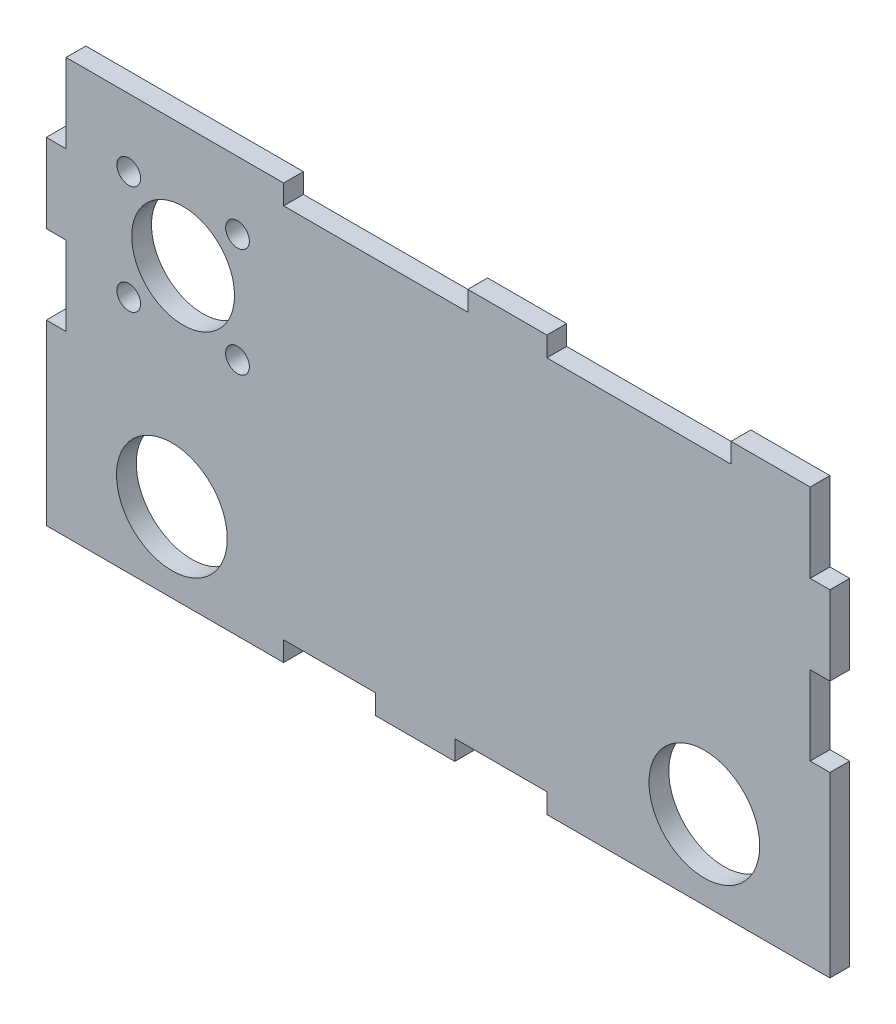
ISO-10303-21;
HEADER;
FILE_DESCRIPTION(('STEP AP214'),'2;1');
FILE_NAME('part.step','',(''),(''),'','','');
FILE_SCHEMA(('AUTOMOTIVE_DESIGN { 1 0 10303 214 1 1 1 1 }'));
ENDSEC;
DATA;
#1=APPLICATION_CONTEXT('core data for automotive mechanical design processes');
#2=APPLICATION_PROTOCOL_DEFINITION('international standard','automotive_design',2000,#1);
#3=PRODUCT_CONTEXT('',#1,'mechanical');
#4=PRODUCT('Part','Part','',(#3));
#5=PRODUCT_RELATED_PRODUCT_CATEGORY('part','',(#4));
#6=PRODUCT_DEFINITION_FORMATION('','',#4);
#7=PRODUCT_DEFINITION_CONTEXT('part definition',#1,'design');
#8=PRODUCT_DEFINITION('design','',#6,#7);
#9=PRODUCT_DEFINITION_SHAPE('','',#8);
#10=(LENGTH_UNIT() NAMED_UNIT(*) SI_UNIT(.MILLI.,.METRE.));
#11=(NAMED_UNIT(*) PLANE_ANGLE_UNIT() SI_UNIT($,.RADIAN.));
#12=(NAMED_UNIT(*) SI_UNIT($,.STERADIAN.) SOLID_ANGLE_UNIT());
#13=UNCERTAINTY_MEASURE_WITH_UNIT(LENGTH_MEASURE(1.E-05),#10,'distance_accuracy_value','');
#14=(GEOMETRIC_REPRESENTATION_CONTEXT(3) GLOBAL_UNCERTAINTY_ASSIGNED_CONTEXT((#13)) GLOBAL_UNIT_ASSIGNED_CONTEXT((#10,
#11,#12)) REPRESENTATION_CONTEXT('',''));
#15=CARTESIAN_POINT('',(0.,0.,0.));
#16=DIRECTION('',(0.,0.,1.));
#17=DIRECTION('',(1.,0.,0.));
#18=AXIS2_PLACEMENT_3D('',#15,#16,#17);
#19=CARTESIAN_POINT('',(0.,0.,5.));
#20=DIRECTION('',(0.,0.,1.));
#21=DIRECTION('',(1.,0.,0.));
#22=AXIS2_PLACEMENT_3D('',#19,#20,#21);
#23=PLANE('',#22);
#24=CARTESIAN_POINT('',(48.3397721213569,87.9243313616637,5.));
#25=DIRECTION('',(0.,0.,1.));
#26=DIRECTION('',(1.,0.,0.));
#27=AXIS2_PLACEMENT_3D('',#24,#25,#26);
#28=CIRCLE('',#27,3.);
#29=CARTESIAN_POINT('',(51.3397721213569,87.9243313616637,5.));
#30=VERTEX_POINT('',#29);
#31=EDGE_CURVE('E569',#30,#30,#28,.T.);
#32=ORIENTED_EDGE('',*,*,#31,.F.);
#33=EDGE_LOOP('',(#32));
#34=FACE_BOUND('',#33,.T.);
#35=CARTESIAN_POINT('',(20.8422278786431,60.42678711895,5.));
#36=DIRECTION('',(0.,0.,1.));
#37=DIRECTION('',(1.,0.,0.));
#38=AXIS2_PLACEMENT_3D('',#35,#36,#37);
#39=CIRCLE('',#38,3.);
#40=CARTESIAN_POINT('',(23.8422278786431,60.42678711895,5.));
#41=VERTEX_POINT('',#40);
#42=EDGE_CURVE('E581',#41,#41,#39,.T.);
#43=ORIENTED_EDGE('',*,*,#42,.F.);
#44=EDGE_LOOP('',(#43));
#45=FACE_BOUND('',#44,.T.);
#46=CARTESIAN_POINT('',(166.37,20.,5.));
#47=DIRECTION('',(0.,0.,1.));
#48=DIRECTION('',(1.,0.,0.));
#49=AXIS2_PLACEMENT_3D('',#46,#47,#48);
#50=CIRCLE('',#49,14.);
#51=CARTESIAN_POINT('',(180.37,20.,5.));
#52=VERTEX_POINT('',#51);
#53=EDGE_CURVE('E593',#52,#52,#50,.T.);
#54=ORIENTED_EDGE('',*,*,#53,.F.);
#55=EDGE_LOOP('',(#54));
#56=FACE_BOUND('',#55,.T.);
#57=DIRECTION('',(1.,0.,0.));
#58=VECTOR('',#57,1.);
#59=CARTESIAN_POINT('',(0.,0.,5.));
#60=LINE('',#59,#58);
#61=CARTESIAN_POINT('',(0.,0.,5.));
#62=VERTEX_POINT('',#61);
#63=CARTESIAN_POINT('',(60.,0.,5.));
#64=VERTEX_POINT('',#63);
#65=EDGE_CURVE('E343',#62,#64,#60,.T.);
#66=ORIENTED_EDGE('',*,*,#65,.T.);
#67=DIRECTION('',(0.,1.,0.));
#68=VECTOR('',#67,1.);
#69=CARTESIAN_POINT('',(60.,0.,5.));
#70=LINE('',#69,#68);
#71=CARTESIAN_POINT('',(60.,5.,5.));
#72=VERTEX_POINT('',#71);
#73=EDGE_CURVE('E171',#64,#72,#70,.T.);
#74=ORIENTED_EDGE('',*,*,#73,.T.);
#75=DIRECTION('',(1.,0.,0.));
#76=VECTOR('',#75,1.);
#77=CARTESIAN_POINT('',(60.,5.,5.));
#78=LINE('',#77,#76);
#79=CARTESIAN_POINT('',(83.28,5.,5.));
#80=VERTEX_POINT('',#79);
#81=EDGE_CURVE('E430',#72,#80,#78,.T.);
#82=ORIENTED_EDGE('',*,*,#81,.T.);
#83=DIRECTION('',(0.,-1.,0.));
#84=VECTOR('',#83,1.);
#85=CARTESIAN_POINT('',(83.28,5.,5.));
#86=LINE('',#85,#84);
#87=CARTESIAN_POINT('',(83.28,0.,5.));
#88=VERTEX_POINT('',#87);
#89=EDGE_CURVE('E449',#80,#88,#86,.T.);
#90=ORIENTED_EDGE('',*,*,#89,.T.);
#91=DIRECTION('',(1.,0.,0.));
#92=VECTOR('',#91,1.);
#93=CARTESIAN_POINT('',(83.28,0.,5.));
#94=LINE('',#93,#92);
#95=CARTESIAN_POINT('',(103.28,0.,5.));
#96=VERTEX_POINT('',#95);
#97=EDGE_CURVE('E446',#88,#96,#94,.T.);
#98=ORIENTED_EDGE('',*,*,#97,.T.);
#99=DIRECTION('',(0.,1.,0.));
#100=VECTOR('',#99,1.);
#101=CARTESIAN_POINT('',(103.28,0.,5.));
#102=LINE('',#101,#100);
#103=CARTESIAN_POINT('',(103.28,5.,5.));
#104=VERTEX_POINT('',#103);
#105=EDGE_CURVE('E448',#96,#104,#102,.T.);
#106=ORIENTED_EDGE('',*,*,#105,.T.);
#107=DIRECTION('',(1.,0.,0.));
#108=VECTOR('',#107,1.);
#109=CARTESIAN_POINT('',(103.28,5.,5.));
#110=LINE('',#109,#108);
#111=CARTESIAN_POINT('',(126.56,5.,5.));
#112=VERTEX_POINT('',#111);
#113=EDGE_CURVE('E451',#104,#112,#110,.T.);
#114=ORIENTED_EDGE('',*,*,#113,.T.);
#115=DIRECTION('',(0.,-1.,0.));
#116=VECTOR('',#115,1.);
#117=CARTESIAN_POINT('',(126.56,5.,5.));
#118=LINE('',#117,#116);
#119=CARTESIAN_POINT('',(126.56,0.,5.));
#120=VERTEX_POINT('',#119);
#121=EDGE_CURVE('E457',#112,#120,#118,.T.);
#122=ORIENTED_EDGE('',*,*,#121,.T.);
#123=DIRECTION('',(1.,0.,0.));
#124=VECTOR('',#123,1.);
#125=CARTESIAN_POINT('',(126.56,0.,5.));
#126=LINE('',#125,#124);
#127=CARTESIAN_POINT('',(198.12,0.,5.));
#128=VERTEX_POINT('',#127);
#129=EDGE_CURVE('E459',#120,#128,#126,.T.);
#130=ORIENTED_EDGE('',*,*,#129,.T.);
#131=DIRECTION('',(0.,1.,0.));
#132=VECTOR('',#131,1.);
#133=CARTESIAN_POINT('',(198.12,45.,5.));
#134=LINE('',#133,#132);
#135=CARTESIAN_POINT('',(198.12,45.,5.));
#136=VERTEX_POINT('',#135);
#137=EDGE_CURVE('E461',#128,#136,#134,.T.);
#138=ORIENTED_EDGE('',*,*,#137,.T.);
#139=DIRECTION('',(-1.,0.,0.));
#140=VECTOR('',#139,1.);
#141=CARTESIAN_POINT('',(193.12,45.,5.));
#142=LINE('',#141,#140);
#143=CARTESIAN_POINT('',(193.12,45.,5.));
#144=VERTEX_POINT('',#143);
#145=EDGE_CURVE('E463',#136,#144,#142,.T.);
#146=ORIENTED_EDGE('',*,*,#145,.T.);
#147=DIRECTION('',(0.,1.,0.));
#148=VECTOR('',#147,1.);
#149=CARTESIAN_POINT('',(193.12,65.,5.));
#150=LINE('',#149,#148);
#151=CARTESIAN_POINT('',(193.12,65.,5.));
#152=VERTEX_POINT('',#151);
#153=EDGE_CURVE('E465',#144,#152,#150,.T.);
#154=ORIENTED_EDGE('',*,*,#153,.T.);
#155=DIRECTION('',(1.,0.,0.));
#156=VECTOR('',#155,1.);
#157=CARTESIAN_POINT('',(198.12,65.,5.));
#158=LINE('',#157,#156);
#159=CARTESIAN_POINT('',(198.12,65.,5.));
#160=VERTEX_POINT('',#159);
#161=EDGE_CURVE('E467',#152,#160,#158,.T.);
#162=ORIENTED_EDGE('',*,*,#161,.T.);
#163=DIRECTION('',(0.,1.,0.));
#164=VECTOR('',#163,1.);
#165=CARTESIAN_POINT('',(198.12,85.,5.));
#166=LINE('',#165,#164);
#167=CARTESIAN_POINT('',(198.12,85.,5.));
#168=VERTEX_POINT('',#167);
#169=EDGE_CURVE('E469',#160,#168,#166,.T.);
#170=ORIENTED_EDGE('',*,*,#169,.T.);
#171=DIRECTION('',(-1.,0.,0.));
#172=VECTOR('',#171,1.);
#173=CARTESIAN_POINT('',(193.12,85.,5.));
#174=LINE('',#173,#172);
#175=CARTESIAN_POINT('',(193.12,85.,5.));
#176=VERTEX_POINT('',#175);
#177=EDGE_CURVE('E471',#168,#176,#174,.T.);
#178=ORIENTED_EDGE('',*,*,#177,.T.);
#179=DIRECTION('',(0.,1.,0.));
#180=VECTOR('',#179,1.);
#181=CARTESIAN_POINT('',(193.12,105.,5.));
#182=LINE('',#181,#180);
#183=CARTESIAN_POINT('',(193.12,105.,5.));
#184=VERTEX_POINT('',#183);
#185=EDGE_CURVE('E473',#176,#184,#182,.T.);
#186=ORIENTED_EDGE('',*,*,#185,.T.);
#187=DIRECTION('',(-1.,0.,0.));
#188=VECTOR('',#187,1.);
#189=CARTESIAN_POINT('',(173.12,105.,5.));
#190=LINE('',#189,#188);
#191=CARTESIAN_POINT('',(173.12,105.,5.));
#192=VERTEX_POINT('',#191);
#193=EDGE_CURVE('E475',#184,#192,#190,.T.);
#194=ORIENTED_EDGE('',*,*,#193,.T.);
#195=DIRECTION('',(0.,-1.,0.));
#196=VECTOR('',#195,1.);
#197=CARTESIAN_POINT('',(173.12,100.,5.));
#198=LINE('',#197,#196);
#199=CARTESIAN_POINT('',(173.12,100.,5.));
#200=VERTEX_POINT('',#199);
#201=EDGE_CURVE('E477',#192,#200,#198,.T.);
#202=ORIENTED_EDGE('',*,*,#201,.T.);
#203=DIRECTION('',(-1.,0.,0.));
#204=VECTOR('',#203,1.);
#205=CARTESIAN_POINT('',(126.56,100.,5.));
#206=LINE('',#205,#204);
#207=CARTESIAN_POINT('',(126.56,100.,5.));
#208=VERTEX_POINT('',#207);
#209=EDGE_CURVE('E479',#200,#208,#206,.T.);
#210=ORIENTED_EDGE('',*,*,#209,.T.);
#211=DIRECTION('',(0.,1.,0.));
#212=VECTOR('',#211,1.);
#213=CARTESIAN_POINT('',(126.56,105.,5.));
#214=LINE('',#213,#212);
#215=CARTESIAN_POINT('',(126.56,105.,5.));
#216=VERTEX_POINT('',#215);
#217=EDGE_CURVE('E481',#208,#216,#214,.T.);
#218=ORIENTED_EDGE('',*,*,#217,.T.);
#219=DIRECTION('',(-1.,0.,0.));
#220=VECTOR('',#219,1.);
#221=CARTESIAN_POINT('',(106.56,105.,5.));
#222=LINE('',#221,#220);
#223=CARTESIAN_POINT('',(106.56,105.,5.));
#224=VERTEX_POINT('',#223);
#225=EDGE_CURVE('E483',#216,#224,#222,.T.);
#226=ORIENTED_EDGE('',*,*,#225,.T.);
#227=DIRECTION('',(0.,-1.,0.));
#228=VECTOR('',#227,1.);
#229=CARTESIAN_POINT('',(106.56,100.,5.));
#230=LINE('',#229,#228);
#231=CARTESIAN_POINT('',(106.56,100.,5.));
#232=VERTEX_POINT('',#231);
#233=EDGE_CURVE('E485',#224,#232,#230,.T.);
#234=ORIENTED_EDGE('',*,*,#233,.T.);
#235=DIRECTION('',(-1.,0.,0.));
#236=VECTOR('',#235,1.);
#237=CARTESIAN_POINT('',(60.,100.,5.));
#238=LINE('',#237,#236);
#239=CARTESIAN_POINT('',(60.,100.,5.));
#240=VERTEX_POINT('',#239);
#241=EDGE_CURVE('E487',#232,#240,#238,.T.);
#242=ORIENTED_EDGE('',*,*,#241,.T.);
#243=DIRECTION('',(0.,1.,0.));
#244=VECTOR('',#243,1.);
#245=CARTESIAN_POINT('',(60.,105.,5.));
#246=LINE('',#245,#244);
#247=CARTESIAN_POINT('',(60.,105.,5.));
#248=VERTEX_POINT('',#247);
#249=EDGE_CURVE('E489',#240,#248,#246,.T.);
#250=ORIENTED_EDGE('',*,*,#249,.T.);
#251=DIRECTION('',(-1.,0.,0.));
#252=VECTOR('',#251,1.);
#253=CARTESIAN_POINT('',(5.,105.,5.));
#254=LINE('',#253,#252);
#255=CARTESIAN_POINT('',(5.,105.,5.));
#256=VERTEX_POINT('',#255);
#257=EDGE_CURVE('E491',#248,#256,#254,.T.);
#258=ORIENTED_EDGE('',*,*,#257,.T.);
#259=DIRECTION('',(0.,-1.,0.));
#260=VECTOR('',#259,1.);
#261=CARTESIAN_POINT('',(5.,85.,5.));
#262=LINE('',#261,#260);
#263=CARTESIAN_POINT('',(5.,85.,5.));
#264=VERTEX_POINT('',#263);
#265=EDGE_CURVE('E493',#256,#264,#262,.T.);
#266=ORIENTED_EDGE('',*,*,#265,.T.);
#267=DIRECTION('',(-1.,0.,0.));
#268=VECTOR('',#267,1.);
#269=CARTESIAN_POINT('',(0.,85.,5.));
#270=LINE('',#269,#268);
#271=CARTESIAN_POINT('',(0.,85.,5.));
#272=VERTEX_POINT('',#271);
#273=EDGE_CURVE('E495',#264,#272,#270,.T.);
#274=ORIENTED_EDGE('',*,*,#273,.T.);
#275=DIRECTION('',(0.,-1.,0.));
#276=VECTOR('',#275,1.);
#277=CARTESIAN_POINT('',(0.,65.,5.));
#278=LINE('',#277,#276);
#279=CARTESIAN_POINT('',(0.,65.,5.));
#280=VERTEX_POINT('',#279);
#281=EDGE_CURVE('E497',#272,#280,#278,.T.);
#282=ORIENTED_EDGE('',*,*,#281,.T.);
#283=DIRECTION('',(1.,0.,0.));
#284=VECTOR('',#283,1.);
#285=CARTESIAN_POINT('',(5.,65.,5.));
#286=LINE('',#285,#284);
#287=CARTESIAN_POINT('',(5.,65.,5.));
#288=VERTEX_POINT('',#287);
#289=EDGE_CURVE('E262',#280,#288,#286,.T.);
#290=ORIENTED_EDGE('',*,*,#289,.T.);
#291=DIRECTION('',(0.,-1.,0.));
#292=VECTOR('',#291,1.);
#293=CARTESIAN_POINT('',(5.,45.,5.));
#294=LINE('',#293,#292);
#295=CARTESIAN_POINT('',(5.,45.,5.));
#296=VERTEX_POINT('',#295);
#297=EDGE_CURVE('E256',#288,#296,#294,.T.);
#298=ORIENTED_EDGE('',*,*,#297,.T.);
#299=DIRECTION('',(-1.,0.,0.));
#300=VECTOR('',#299,1.);
#301=CARTESIAN_POINT('',(0.,45.,5.));
#302=LINE('',#301,#300);
#303=CARTESIAN_POINT('',(0.,45.,5.));
#304=VERTEX_POINT('',#303);
#305=EDGE_CURVE('E260',#296,#304,#302,.T.);
#306=ORIENTED_EDGE('',*,*,#305,.T.);
#307=DIRECTION('',(0.,-1.,0.));
#308=VECTOR('',#307,1.);
#309=CARTESIAN_POINT('',(0.,0.,5.));
#310=LINE('',#309,#308);
#311=EDGE_CURVE('E56',#304,#62,#310,.T.);
#312=ORIENTED_EDGE('',*,*,#311,.T.);
#313=EDGE_LOOP('',(#66,#74,#82,#90,#98,#106,#114,#122,#130,#138,#146,#154,#162,#170,#178,#186,
#194,#202,#210,#218,#226,#234,#242,#250,#258,#266,#274,#282,#290,#298,#306,#312));
#314=FACE_BOUND('',#313,.T.);
#315=CARTESIAN_POINT('',(31.75,20.,5.));
#316=DIRECTION('',(0.,0.,1.));
#317=DIRECTION('',(1.,0.,0.));
#318=AXIS2_PLACEMENT_3D('',#315,#316,#317);
#319=CIRCLE('',#318,14.);
#320=CARTESIAN_POINT('',(45.75,20.,5.));
#321=VERTEX_POINT('',#320);
#322=EDGE_CURVE('E284',#321,#321,#319,.T.);
#323=ORIENTED_EDGE('',*,*,#322,.F.);
#324=EDGE_LOOP('',(#323));
#325=FACE_BOUND('',#324,.T.);
#326=CARTESIAN_POINT('',(20.8422278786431,87.9243313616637,5.));
#327=DIRECTION('',(0.,0.,1.));
#328=DIRECTION('',(1.,0.,0.));
#329=AXIS2_PLACEMENT_3D('',#326,#327,#328);
#330=CIRCLE('',#329,3.);
#331=CARTESIAN_POINT('',(23.8422278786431,87.9243313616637,5.));
#332=VERTEX_POINT('',#331);
#333=EDGE_CURVE('E587',#332,#332,#330,.T.);
#334=ORIENTED_EDGE('',*,*,#333,.F.);
#335=EDGE_LOOP('',(#334));
#336=FACE_BOUND('',#335,.T.);
#337=CARTESIAN_POINT('',(48.3397721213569,60.42678711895,5.));
#338=DIRECTION('',(0.,0.,1.));
#339=DIRECTION('',(1.,0.,0.));
#340=AXIS2_PLACEMENT_3D('',#337,#338,#339);
#341=CIRCLE('',#340,3.);
#342=CARTESIAN_POINT('',(51.3397721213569,60.42678711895,5.));
#343=VERTEX_POINT('',#342);
#344=EDGE_CURVE('E575',#343,#343,#341,.T.);
#345=ORIENTED_EDGE('',*,*,#344,.F.);
#346=EDGE_LOOP('',(#345));
#347=FACE_BOUND('',#346,.T.);
#348=CARTESIAN_POINT('',(34.591,74.1755592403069,5.));
#349=DIRECTION('',(0.,0.,1.));
#350=DIRECTION('',(1.,0.,0.));
#351=AXIS2_PLACEMENT_3D('',#348,#349,#350);
#352=CIRCLE('',#351,13.);
#353=CARTESIAN_POINT('',(47.591,74.1755592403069,5.));
#354=VERTEX_POINT('',#353);
#355=EDGE_CURVE('E560',#354,#354,#352,.T.);
#356=ORIENTED_EDGE('',*,*,#355,.F.);
#357=EDGE_LOOP('',(#356));
#358=FACE_BOUND('',#357,.T.);
#359=ADVANCED_FACE('F39',(#34,#45,#56,#314,#325,#336,#347,#358),#23,.T.);
#360=CARTESIAN_POINT('',(0.,0.,0.));
#361=DIRECTION('',(0.,0.,1.));
#362=DIRECTION('',(1.,0.,0.));
#363=AXIS2_PLACEMENT_3D('',#360,#361,#362);
#364=PLANE('',#363);
#365=DIRECTION('',(1.,0.,0.));
#366=VECTOR('',#365,1.);
#367=CARTESIAN_POINT('',(0.,0.,0.));
#368=LINE('',#367,#366);
#369=CARTESIAN_POINT('',(0.,0.,0.));
#370=VERTEX_POINT('',#369);
#371=CARTESIAN_POINT('',(60.,0.,0.));
#372=VERTEX_POINT('',#371);
#373=EDGE_CURVE('E280',#370,#372,#368,.T.);
#374=ORIENTED_EDGE('',*,*,#373,.F.);
#375=DIRECTION('',(0.,-1.,0.));
#376=VECTOR('',#375,1.);
#377=CARTESIAN_POINT('',(0.,0.,0.));
#378=LINE('',#377,#376);
#379=CARTESIAN_POINT('',(0.,45.,0.));
#380=VERTEX_POINT('',#379);
#381=EDGE_CURVE('E163',#380,#370,#378,.T.);
#382=ORIENTED_EDGE('',*,*,#381,.F.);
#383=DIRECTION('',(-1.,0.,0.));
#384=VECTOR('',#383,1.);
#385=CARTESIAN_POINT('',(0.,45.,0.));
#386=LINE('',#385,#384);
#387=CARTESIAN_POINT('',(5.,45.,0.));
#388=VERTEX_POINT('',#387);
#389=EDGE_CURVE('E157',#388,#380,#386,.T.);
#390=ORIENTED_EDGE('',*,*,#389,.F.);
#391=DIRECTION('',(0.,-1.,0.));
#392=VECTOR('',#391,1.);
#393=CARTESIAN_POINT('',(5.,45.,0.));
#394=LINE('',#393,#392);
#395=CARTESIAN_POINT('',(5.,65.,0.));
#396=VERTEX_POINT('',#395);
#397=EDGE_CURVE('E270',#396,#388,#394,.T.);
#398=ORIENTED_EDGE('',*,*,#397,.F.);
#399=DIRECTION('',(1.,0.,0.));
#400=VECTOR('',#399,1.);
#401=CARTESIAN_POINT('',(5.,65.,0.));
#402=LINE('',#401,#400);
#403=CARTESIAN_POINT('',(0.,65.,0.));
#404=VERTEX_POINT('',#403);
#405=EDGE_CURVE('E338',#404,#396,#402,.T.);
#406=ORIENTED_EDGE('',*,*,#405,.F.);
#407=DIRECTION('',(0.,-1.,0.));
#408=VECTOR('',#407,1.);
#409=CARTESIAN_POINT('',(0.,65.,0.));
#410=LINE('',#409,#408);
#411=CARTESIAN_POINT('',(0.,85.,0.));
#412=VERTEX_POINT('',#411);
#413=EDGE_CURVE('E336',#412,#404,#410,.T.);
#414=ORIENTED_EDGE('',*,*,#413,.F.);
#415=DIRECTION('',(-1.,0.,0.));
#416=VECTOR('',#415,1.);
#417=CARTESIAN_POINT('',(0.,85.,0.));
#418=LINE('',#417,#416);
#419=CARTESIAN_POINT('',(5.,85.,0.));
#420=VERTEX_POINT('',#419);
#421=EDGE_CURVE('E334',#420,#412,#418,.T.);
#422=ORIENTED_EDGE('',*,*,#421,.F.);
#423=DIRECTION('',(0.,-1.,0.));
#424=VECTOR('',#423,1.);
#425=CARTESIAN_POINT('',(5.,85.,0.));
#426=LINE('',#425,#424);
#427=CARTESIAN_POINT('',(5.,105.,0.));
#428=VERTEX_POINT('',#427);
#429=EDGE_CURVE('E332',#428,#420,#426,.T.);
#430=ORIENTED_EDGE('',*,*,#429,.F.);
#431=DIRECTION('',(-1.,0.,0.));
#432=VECTOR('',#431,1.);
#433=CARTESIAN_POINT('',(5.,105.,0.));
#434=LINE('',#433,#432);
#435=CARTESIAN_POINT('',(60.,105.,0.));
#436=VERTEX_POINT('',#435);
#437=EDGE_CURVE('E330',#436,#428,#434,.T.);
#438=ORIENTED_EDGE('',*,*,#437,.F.);
#439=DIRECTION('',(0.,1.,0.));
#440=VECTOR('',#439,1.);
#441=CARTESIAN_POINT('',(60.,105.,0.));
#442=LINE('',#441,#440);
#443=CARTESIAN_POINT('',(60.,100.,0.));
#444=VERTEX_POINT('',#443);
#445=EDGE_CURVE('E328',#444,#436,#442,.T.);
#446=ORIENTED_EDGE('',*,*,#445,.F.);
#447=DIRECTION('',(-1.,0.,0.));
#448=VECTOR('',#447,1.);
#449=CARTESIAN_POINT('',(60.,100.,0.));
#450=LINE('',#449,#448);
#451=CARTESIAN_POINT('',(106.56,100.,0.));
#452=VERTEX_POINT('',#451);
#453=EDGE_CURVE('E326',#452,#444,#450,.T.);
#454=ORIENTED_EDGE('',*,*,#453,.F.);
#455=DIRECTION('',(0.,-1.,0.));
#456=VECTOR('',#455,1.);
#457=CARTESIAN_POINT('',(106.56,100.,0.));
#458=LINE('',#457,#456);
#459=CARTESIAN_POINT('',(106.56,105.,0.));
#460=VERTEX_POINT('',#459);
#461=EDGE_CURVE('E324',#460,#452,#458,.T.);
#462=ORIENTED_EDGE('',*,*,#461,.F.);
#463=DIRECTION('',(-1.,0.,0.));
#464=VECTOR('',#463,1.);
#465=CARTESIAN_POINT('',(106.56,105.,0.));
#466=LINE('',#465,#464);
#467=CARTESIAN_POINT('',(126.56,105.,0.));
#468=VERTEX_POINT('',#467);
#469=EDGE_CURVE('E322',#468,#460,#466,.T.);
#470=ORIENTED_EDGE('',*,*,#469,.F.);
#471=DIRECTION('',(0.,1.,0.));
#472=VECTOR('',#471,1.);
#473=CARTESIAN_POINT('',(126.56,105.,0.));
#474=LINE('',#473,#472);
#475=CARTESIAN_POINT('',(126.56,100.,0.));
#476=VERTEX_POINT('',#475);
#477=EDGE_CURVE('E320',#476,#468,#474,.T.);
#478=ORIENTED_EDGE('',*,*,#477,.F.);
#479=DIRECTION('',(-1.,0.,0.));
#480=VECTOR('',#479,1.);
#481=CARTESIAN_POINT('',(126.56,100.,0.));
#482=LINE('',#481,#480);
#483=CARTESIAN_POINT('',(173.12,100.,0.));
#484=VERTEX_POINT('',#483);
#485=EDGE_CURVE('E318',#484,#476,#482,.T.);
#486=ORIENTED_EDGE('',*,*,#485,.F.);
#487=DIRECTION('',(0.,-1.,0.));
#488=VECTOR('',#487,1.);
#489=CARTESIAN_POINT('',(173.12,100.,0.));
#490=LINE('',#489,#488);
#491=CARTESIAN_POINT('',(173.12,105.,0.));
#492=VERTEX_POINT('',#491);
#493=EDGE_CURVE('E316',#492,#484,#490,.T.);
#494=ORIENTED_EDGE('',*,*,#493,.F.);
#495=DIRECTION('',(-1.,0.,0.));
#496=VECTOR('',#495,1.);
#497=CARTESIAN_POINT('',(173.12,105.,0.));
#498=LINE('',#497,#496);
#499=CARTESIAN_POINT('',(193.12,105.,0.));
#500=VERTEX_POINT('',#499);
#501=EDGE_CURVE('E314',#500,#492,#498,.T.);
#502=ORIENTED_EDGE('',*,*,#501,.F.);
#503=DIRECTION('',(0.,1.,0.));
#504=VECTOR('',#503,1.);
#505=CARTESIAN_POINT('',(193.12,105.,0.));
#506=LINE('',#505,#504);
#507=CARTESIAN_POINT('',(193.12,85.,0.));
#508=VERTEX_POINT('',#507);
#509=EDGE_CURVE('E312',#508,#500,#506,.T.);
#510=ORIENTED_EDGE('',*,*,#509,.F.);
#511=DIRECTION('',(-1.,0.,0.));
#512=VECTOR('',#511,1.);
#513=CARTESIAN_POINT('',(193.12,85.,0.));
#514=LINE('',#513,#512);
#515=CARTESIAN_POINT('',(198.12,85.,0.));
#516=VERTEX_POINT('',#515);
#517=EDGE_CURVE('E310',#516,#508,#514,.T.);
#518=ORIENTED_EDGE('',*,*,#517,.F.);
#519=DIRECTION('',(0.,1.,0.));
#520=VECTOR('',#519,1.);
#521=CARTESIAN_POINT('',(198.12,85.,0.));
#522=LINE('',#521,#520);
#523=CARTESIAN_POINT('',(198.12,65.,0.));
#524=VERTEX_POINT('',#523);
#525=EDGE_CURVE('E308',#524,#516,#522,.T.);
#526=ORIENTED_EDGE('',*,*,#525,.F.);
#527=DIRECTION('',(1.,0.,0.));
#528=VECTOR('',#527,1.);
#529=CARTESIAN_POINT('',(198.12,65.,0.));
#530=LINE('',#529,#528);
#531=CARTESIAN_POINT('',(193.12,65.,0.));
#532=VERTEX_POINT('',#531);
#533=EDGE_CURVE('E306',#532,#524,#530,.T.);
#534=ORIENTED_EDGE('',*,*,#533,.F.);
#535=DIRECTION('',(0.,1.,0.));
#536=VECTOR('',#535,1.);
#537=CARTESIAN_POINT('',(193.12,65.,0.));
#538=LINE('',#537,#536);
#539=CARTESIAN_POINT('',(193.12,45.,0.));
#540=VERTEX_POINT('',#539);
#541=EDGE_CURVE('E304',#540,#532,#538,.T.);
#542=ORIENTED_EDGE('',*,*,#541,.F.);
#543=DIRECTION('',(-1.,0.,0.));
#544=VECTOR('',#543,1.);
#545=CARTESIAN_POINT('',(193.12,45.,0.));
#546=LINE('',#545,#544);
#547=CARTESIAN_POINT('',(198.12,45.,0.));
#548=VERTEX_POINT('',#547);
#549=EDGE_CURVE('E302',#548,#540,#546,.T.);
#550=ORIENTED_EDGE('',*,*,#549,.F.);
#551=DIRECTION('',(0.,1.,0.));
#552=VECTOR('',#551,1.);
#553=CARTESIAN_POINT('',(198.12,45.,0.));
#554=LINE('',#553,#552);
#555=CARTESIAN_POINT('',(198.12,0.,0.));
#556=VERTEX_POINT('',#555);
#557=EDGE_CURVE('E300',#556,#548,#554,.T.);
#558=ORIENTED_EDGE('',*,*,#557,.F.);
#559=DIRECTION('',(1.,0.,0.));
#560=VECTOR('',#559,1.);
#561=CARTESIAN_POINT('',(126.56,0.,0.));
#562=LINE('',#561,#560);
#563=CARTESIAN_POINT('',(126.56,0.,0.));
#564=VERTEX_POINT('',#563);
#565=EDGE_CURVE('E298',#564,#556,#562,.T.);
#566=ORIENTED_EDGE('',*,*,#565,.F.);
#567=DIRECTION('',(0.,-1.,0.));
#568=VECTOR('',#567,1.);
#569=CARTESIAN_POINT('',(126.56,5.,0.));
#570=LINE('',#569,#568);
#571=CARTESIAN_POINT('',(126.56,5.,0.));
#572=VERTEX_POINT('',#571);
#573=EDGE_CURVE('E296',#572,#564,#570,.T.);
#574=ORIENTED_EDGE('',*,*,#573,.F.);
#575=DIRECTION('',(1.,0.,0.));
#576=VECTOR('',#575,1.);
#577=CARTESIAN_POINT('',(103.28,5.,0.));
#578=LINE('',#577,#576);
#579=CARTESIAN_POINT('',(103.28,5.,0.));
#580=VERTEX_POINT('',#579);
#581=EDGE_CURVE('E294',#580,#572,#578,.T.);
#582=ORIENTED_EDGE('',*,*,#581,.F.);
#583=DIRECTION('',(0.,1.,0.));
#584=VECTOR('',#583,1.);
#585=CARTESIAN_POINT('',(103.28,0.,0.));
#586=LINE('',#585,#584);
#587=CARTESIAN_POINT('',(103.28,0.,0.));
#588=VERTEX_POINT('',#587);
#589=EDGE_CURVE('E292',#588,#580,#586,.T.);
#590=ORIENTED_EDGE('',*,*,#589,.F.);
#591=DIRECTION('',(1.,0.,0.));
#592=VECTOR('',#591,1.);
#593=CARTESIAN_POINT('',(83.28,0.,0.));
#594=LINE('',#593,#592);
#595=CARTESIAN_POINT('',(83.28,0.,0.));
#596=VERTEX_POINT('',#595);
#597=EDGE_CURVE('E290',#596,#588,#594,.T.);
#598=ORIENTED_EDGE('',*,*,#597,.F.);
#599=DIRECTION('',(0.,-1.,0.));
#600=VECTOR('',#599,1.);
#601=CARTESIAN_POINT('',(83.28,5.,0.));
#602=LINE('',#601,#600);
#603=CARTESIAN_POINT('',(83.28,5.,0.));
#604=VERTEX_POINT('',#603);
#605=EDGE_CURVE('E288',#604,#596,#602,.T.);
#606=ORIENTED_EDGE('',*,*,#605,.F.);
#607=DIRECTION('',(1.,0.,0.));
#608=VECTOR('',#607,1.);
#609=CARTESIAN_POINT('',(60.,5.,0.));
#610=LINE('',#609,#608);
#611=CARTESIAN_POINT('',(60.,5.,0.));
#612=VERTEX_POINT('',#611);
#613=EDGE_CURVE('E286',#612,#604,#610,.T.);
#614=ORIENTED_EDGE('',*,*,#613,.F.);
#615=DIRECTION('',(0.,1.,0.));
#616=VECTOR('',#615,1.);
#617=CARTESIAN_POINT('',(60.,0.,0.));
#618=LINE('',#617,#616);
#619=EDGE_CURVE('E283',#372,#612,#618,.T.);
#620=ORIENTED_EDGE('',*,*,#619,.F.);
#621=EDGE_LOOP('',(#374,#382,#390,#398,#406,#414,#422,#430,#438,#446,#454,#462,#470,#478,#486,
#494,#502,#510,#518,#526,#534,#542,#550,#558,#566,#574,#582,#590,#598,#606,#614,#620));
#622=FACE_BOUND('',#621,.T.);
#623=CARTESIAN_POINT('',(31.75,20.,0.));
#624=DIRECTION('',(0.,0.,1.));
#625=DIRECTION('',(1.,0.,0.));
#626=AXIS2_PLACEMENT_3D('',#623,#624,#625);
#627=CIRCLE('',#626,14.);
#628=CARTESIAN_POINT('',(45.75,20.,0.));
#629=VERTEX_POINT('',#628);
#630=EDGE_CURVE('E596',#629,#629,#627,.T.);
#631=ORIENTED_EDGE('',*,*,#630,.T.);
#632=EDGE_LOOP('',(#631));
#633=FACE_BOUND('',#632,.T.);
#634=CARTESIAN_POINT('',(166.37,20.,0.));
#635=DIRECTION('',(0.,0.,1.));
#636=DIRECTION('',(1.,0.,0.));
#637=AXIS2_PLACEMENT_3D('',#634,#635,#636);
#638=CIRCLE('',#637,14.);
#639=CARTESIAN_POINT('',(180.37,20.,0.));
#640=VERTEX_POINT('',#639);
#641=EDGE_CURVE('E590',#640,#640,#638,.T.);
#642=ORIENTED_EDGE('',*,*,#641,.T.);
#643=EDGE_LOOP('',(#642));
#644=FACE_BOUND('',#643,.T.);
#645=CARTESIAN_POINT('',(20.8422278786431,87.9243313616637,0.));
#646=DIRECTION('',(0.,0.,1.));
#647=DIRECTION('',(1.,0.,0.));
#648=AXIS2_PLACEMENT_3D('',#645,#646,#647);
#649=CIRCLE('',#648,3.);
#650=CARTESIAN_POINT('',(23.8422278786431,87.9243313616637,0.));
#651=VERTEX_POINT('',#650);
#652=EDGE_CURVE('E584',#651,#651,#649,.T.);
#653=ORIENTED_EDGE('',*,*,#652,.T.);
#654=EDGE_LOOP('',(#653));
#655=FACE_BOUND('',#654,.T.);
#656=CARTESIAN_POINT('',(20.8422278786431,60.42678711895,0.));
#657=DIRECTION('',(0.,0.,1.));
#658=DIRECTION('',(1.,0.,0.));
#659=AXIS2_PLACEMENT_3D('',#656,#657,#658);
#660=CIRCLE('',#659,3.);
#661=CARTESIAN_POINT('',(23.8422278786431,60.42678711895,0.));
#662=VERTEX_POINT('',#661);
#663=EDGE_CURVE('E578',#662,#662,#660,.T.);
#664=ORIENTED_EDGE('',*,*,#663,.T.);
#665=EDGE_LOOP('',(#664));
#666=FACE_BOUND('',#665,.T.);
#667=CARTESIAN_POINT('',(48.3397721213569,60.42678711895,0.));
#668=DIRECTION('',(0.,0.,1.));
#669=DIRECTION('',(1.,0.,0.));
#670=AXIS2_PLACEMENT_3D('',#667,#668,#669);
#671=CIRCLE('',#670,3.);
#672=CARTESIAN_POINT('',(51.3397721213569,60.42678711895,0.));
#673=VERTEX_POINT('',#672);
#674=EDGE_CURVE('E572',#673,#673,#671,.T.);
#675=ORIENTED_EDGE('',*,*,#674,.T.);
#676=EDGE_LOOP('',(#675));
#677=FACE_BOUND('',#676,.T.);
#678=CARTESIAN_POINT('',(48.3397721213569,87.9243313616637,0.));
#679=DIRECTION('',(0.,0.,1.));
#680=DIRECTION('',(1.,0.,0.));
#681=AXIS2_PLACEMENT_3D('',#678,#679,#680);
#682=CIRCLE('',#681,3.);
#683=CARTESIAN_POINT('',(51.3397721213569,87.9243313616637,0.));
#684=VERTEX_POINT('',#683);
#685=EDGE_CURVE('E566',#684,#684,#682,.T.);
#686=ORIENTED_EDGE('',*,*,#685,.T.);
#687=EDGE_LOOP('',(#686));
#688=FACE_BOUND('',#687,.T.);
#689=CARTESIAN_POINT('',(34.591,74.1755592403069,0.));
#690=DIRECTION('',(0.,0.,1.));
#691=DIRECTION('',(1.,0.,0.));
#692=AXIS2_PLACEMENT_3D('',#689,#690,#691);
#693=CIRCLE('',#692,13.);
#694=CARTESIAN_POINT('',(47.591,74.1755592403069,0.));
#695=VERTEX_POINT('',#694);
#696=EDGE_CURVE('E563',#695,#695,#693,.T.);
#697=ORIENTED_EDGE('',*,*,#696,.T.);
#698=EDGE_LOOP('',(#697));
#699=FACE_BOUND('',#698,.T.);
#700=ADVANCED_FACE('F434',(#622,#633,#644,#655,#666,#677,#688,#699),#364,.F.);
#701=CARTESIAN_POINT('',(0.,0.,5.));
#702=DIRECTION('',(0.,1.,0.));
#703=DIRECTION('',(0.,0.,1.));
#704=AXIS2_PLACEMENT_3D('',#701,#702,#703);
#705=PLANE('',#704);
#706=ORIENTED_EDGE('',*,*,#373,.T.);
#707=DIRECTION('',(0.,0.,-1.));
#708=VECTOR('',#707,1.);
#709=CARTESIAN_POINT('',(60.,0.,5.));
#710=LINE('',#709,#708);
#711=EDGE_CURVE('E11',#64,#372,#710,.T.);
#712=ORIENTED_EDGE('',*,*,#711,.F.);
#713=ORIENTED_EDGE('',*,*,#65,.F.);
#714=DIRECTION('',(0.,0.,-1.));
#715=VECTOR('',#714,1.);
#716=CARTESIAN_POINT('',(0.,0.,5.));
#717=LINE('',#716,#715);
#718=EDGE_CURVE('E276',#62,#370,#717,.T.);
#719=ORIENTED_EDGE('',*,*,#718,.T.);
#720=EDGE_LOOP('',(#706,#712,#713,#719));
#721=FACE_BOUND('',#720,.T.);
#722=ADVANCED_FACE('F41',(#721),#705,.F.);
#723=CARTESIAN_POINT('',(60.,0.,5.));
#724=DIRECTION('',(-1.,0.,0.));
#725=DIRECTION('',(0.,0.,1.));
#726=AXIS2_PLACEMENT_3D('',#723,#724,#725);
#727=PLANE('',#726);
#728=ORIENTED_EDGE('',*,*,#619,.T.);
#729=DIRECTION('',(0.,0.,-1.));
#730=VECTOR('',#729,1.);
#731=CARTESIAN_POINT('',(60.,5.,5.));
#732=LINE('',#731,#730);
#733=EDGE_CURVE('E48',#72,#612,#732,.T.);
#734=ORIENTED_EDGE('',*,*,#733,.F.);
#735=ORIENTED_EDGE('',*,*,#73,.F.);
#736=ORIENTED_EDGE('',*,*,#711,.T.);
#737=EDGE_LOOP('',(#728,#734,#735,#736));
#738=FACE_BOUND('',#737,.T.);
#739=ADVANCED_FACE('F963',(#738),#727,.F.);
#740=CARTESIAN_POINT('',(60.,5.,5.));
#741=DIRECTION('',(0.,1.,0.));
#742=DIRECTION('',(0.,0.,1.));
#743=AXIS2_PLACEMENT_3D('',#740,#741,#742);
#744=PLANE('',#743);
#745=ORIENTED_EDGE('',*,*,#613,.T.);
#746=DIRECTION('',(0.,0.,-1.));
#747=VECTOR('',#746,1.);
#748=CARTESIAN_POINT('',(83.28,5.,5.));
#749=LINE('',#748,#747);
#750=EDGE_CURVE('E422',#80,#604,#749,.T.);
#751=ORIENTED_EDGE('',*,*,#750,.F.);
#752=ORIENTED_EDGE('',*,*,#81,.F.);
#753=ORIENTED_EDGE('',*,*,#733,.T.);
#754=EDGE_LOOP('',(#745,#751,#752,#753));
#755=FACE_BOUND('',#754,.T.);
#756=ADVANCED_FACE('F428',(#755),#744,.F.);
#757=CARTESIAN_POINT('',(83.28,5.,5.));
#758=DIRECTION('',(1.,0.,0.));
#759=DIRECTION('',(0.,0.,-1.));
#760=AXIS2_PLACEMENT_3D('',#757,#758,#759);
#761=PLANE('',#760);
#762=ORIENTED_EDGE('',*,*,#605,.T.);
#763=DIRECTION('',(0.,0.,-1.));
#764=VECTOR('',#763,1.);
#765=CARTESIAN_POINT('',(83.28,0.,5.));
#766=LINE('',#765,#764);
#767=EDGE_CURVE('E419',#88,#596,#766,.T.);
#768=ORIENTED_EDGE('',*,*,#767,.F.);
#769=ORIENTED_EDGE('',*,*,#89,.F.);
#770=ORIENTED_EDGE('',*,*,#750,.T.);
#771=EDGE_LOOP('',(#762,#768,#769,#770));
#772=FACE_BOUND('',#771,.T.);
#773=ADVANCED_FACE('F440',(#772),#761,.F.);
#774=CARTESIAN_POINT('',(83.28,0.,5.));
#775=DIRECTION('',(0.,1.,0.));
#776=DIRECTION('',(0.,0.,1.));
#777=AXIS2_PLACEMENT_3D('',#774,#775,#776);
#778=PLANE('',#777);
#779=ORIENTED_EDGE('',*,*,#597,.T.);
#780=DIRECTION('',(0.,0.,-1.));
#781=VECTOR('',#780,1.);
#782=CARTESIAN_POINT('',(103.28,0.,5.));
#783=LINE('',#782,#781);
#784=EDGE_CURVE('E416',#96,#588,#783,.T.);
#785=ORIENTED_EDGE('',*,*,#784,.F.);
#786=ORIENTED_EDGE('',*,*,#97,.F.);
#787=ORIENTED_EDGE('',*,*,#767,.T.);
#788=EDGE_LOOP('',(#779,#785,#786,#787));
#789=FACE_BOUND('',#788,.T.);
#790=ADVANCED_FACE('F444',(#789),#778,.F.);
#791=CARTESIAN_POINT('',(103.28,0.,5.));
#792=DIRECTION('',(-1.,0.,0.));
#793=DIRECTION('',(0.,0.,1.));
#794=AXIS2_PLACEMENT_3D('',#791,#792,#793);
#795=PLANE('',#794);
#796=ORIENTED_EDGE('',*,*,#589,.T.);
#797=DIRECTION('',(0.,0.,-1.));
#798=VECTOR('',#797,1.);
#799=CARTESIAN_POINT('',(103.28,5.,5.));
#800=LINE('',#799,#798);
#801=EDGE_CURVE('E413',#104,#580,#800,.T.);
#802=ORIENTED_EDGE('',*,*,#801,.F.);
#803=ORIENTED_EDGE('',*,*,#105,.F.);
#804=ORIENTED_EDGE('',*,*,#784,.T.);
#805=EDGE_LOOP('',(#796,#802,#803,#804));
#806=FACE_BOUND('',#805,.T.);
#807=ADVANCED_FACE('F924',(#806),#795,.F.);
#808=CARTESIAN_POINT('',(103.28,5.,5.));
#809=DIRECTION('',(0.,1.,0.));
#810=DIRECTION('',(0.,0.,1.));
#811=AXIS2_PLACEMENT_3D('',#808,#809,#810);
#812=PLANE('',#811);
#813=ORIENTED_EDGE('',*,*,#581,.T.);
#814=DIRECTION('',(0.,0.,-1.));
#815=VECTOR('',#814,1.);
#816=CARTESIAN_POINT('',(126.56,5.,5.));
#817=LINE('',#816,#815);
#818=EDGE_CURVE('E410',#112,#572,#817,.T.);
#819=ORIENTED_EDGE('',*,*,#818,.F.);
#820=ORIENTED_EDGE('',*,*,#113,.F.);
#821=ORIENTED_EDGE('',*,*,#801,.T.);
#822=EDGE_LOOP('',(#813,#819,#820,#821));
#823=FACE_BOUND('',#822,.T.);
#824=ADVANCED_FACE('F913',(#823),#812,.F.);
#825=CARTESIAN_POINT('',(126.56,5.,5.));
#826=DIRECTION('',(1.,0.,0.));
#827=DIRECTION('',(0.,0.,-1.));
#828=AXIS2_PLACEMENT_3D('',#825,#826,#827);
#829=PLANE('',#828);
#830=ORIENTED_EDGE('',*,*,#573,.T.);
#831=DIRECTION('',(0.,0.,-1.));
#832=VECTOR('',#831,1.);
#833=CARTESIAN_POINT('',(126.56,0.,5.));
#834=LINE('',#833,#832);
#835=EDGE_CURVE('E407',#120,#564,#834,.T.);
#836=ORIENTED_EDGE('',*,*,#835,.F.);
#837=ORIENTED_EDGE('',*,*,#121,.F.);
#838=ORIENTED_EDGE('',*,*,#818,.T.);
#839=EDGE_LOOP('',(#830,#836,#837,#838));
#840=FACE_BOUND('',#839,.T.);
#841=ADVANCED_FACE('F902',(#840),#829,.F.);
#842=CARTESIAN_POINT('',(126.56,0.,5.));
#843=DIRECTION('',(0.,1.,0.));
#844=DIRECTION('',(0.,0.,1.));
#845=AXIS2_PLACEMENT_3D('',#842,#843,#844);
#846=PLANE('',#845);
#847=ORIENTED_EDGE('',*,*,#565,.T.);
#848=DIRECTION('',(0.,0.,-1.));
#849=VECTOR('',#848,1.);
#850=CARTESIAN_POINT('',(198.12,0.,5.));
#851=LINE('',#850,#849);
#852=EDGE_CURVE('E404',#128,#556,#851,.T.);
#853=ORIENTED_EDGE('',*,*,#852,.F.);
#854=ORIENTED_EDGE('',*,*,#129,.F.);
#855=ORIENTED_EDGE('',*,*,#835,.T.);
#856=EDGE_LOOP('',(#847,#853,#854,#855));
#857=FACE_BOUND('',#856,.T.);
#858=ADVANCED_FACE('F891',(#857),#846,.F.);
#859=CARTESIAN_POINT('',(198.12,45.,5.));
#860=DIRECTION('',(-1.,0.,0.));
#861=DIRECTION('',(0.,0.,1.));
#862=AXIS2_PLACEMENT_3D('',#859,#860,#861);
#863=PLANE('',#862);
#864=ORIENTED_EDGE('',*,*,#557,.T.);
#865=DIRECTION('',(0.,0.,-1.));
#866=VECTOR('',#865,1.);
#867=CARTESIAN_POINT('',(198.12,45.,5.));
#868=LINE('',#867,#866);
#869=EDGE_CURVE('E401',#136,#548,#868,.T.);
#870=ORIENTED_EDGE('',*,*,#869,.F.);
#871=ORIENTED_EDGE('',*,*,#137,.F.);
#872=ORIENTED_EDGE('',*,*,#852,.T.);
#873=EDGE_LOOP('',(#864,#870,#871,#872));
#874=FACE_BOUND('',#873,.T.);
#875=ADVANCED_FACE('F880',(#874),#863,.F.);
#876=CARTESIAN_POINT('',(193.12,45.,5.));
#877=DIRECTION('',(0.,-1.,0.));
#878=DIRECTION('',(0.,0.,-1.));
#879=AXIS2_PLACEMENT_3D('',#876,#877,#878);
#880=PLANE('',#879);
#881=ORIENTED_EDGE('',*,*,#549,.T.);
#882=DIRECTION('',(0.,0.,-1.));
#883=VECTOR('',#882,1.);
#884=CARTESIAN_POINT('',(193.12,45.,5.));
#885=LINE('',#884,#883);
#886=EDGE_CURVE('E398',#144,#540,#885,.T.);
#887=ORIENTED_EDGE('',*,*,#886,.F.);
#888=ORIENTED_EDGE('',*,*,#145,.F.);
#889=ORIENTED_EDGE('',*,*,#869,.T.);
#890=EDGE_LOOP('',(#881,#887,#888,#889));
#891=FACE_BOUND('',#890,.T.);
#892=ADVANCED_FACE('F869',(#891),#880,.F.);
#893=CARTESIAN_POINT('',(193.12,65.,5.));
#894=DIRECTION('',(-1.,0.,0.));
#895=DIRECTION('',(0.,0.,1.));
#896=AXIS2_PLACEMENT_3D('',#893,#894,#895);
#897=PLANE('',#896);
#898=ORIENTED_EDGE('',*,*,#541,.T.);
#899=DIRECTION('',(0.,0.,-1.));
#900=VECTOR('',#899,1.);
#901=CARTESIAN_POINT('',(193.12,65.,5.));
#902=LINE('',#901,#900);
#903=EDGE_CURVE('E395',#152,#532,#902,.T.);
#904=ORIENTED_EDGE('',*,*,#903,.F.);
#905=ORIENTED_EDGE('',*,*,#153,.F.);
#906=ORIENTED_EDGE('',*,*,#886,.T.);
#907=EDGE_LOOP('',(#898,#904,#905,#906));
#908=FACE_BOUND('',#907,.T.);
#909=ADVANCED_FACE('F858',(#908),#897,.F.);
#910=CARTESIAN_POINT('',(198.12,65.,5.));
#911=DIRECTION('',(0.,1.,0.));
#912=DIRECTION('',(0.,0.,1.));
#913=AXIS2_PLACEMENT_3D('',#910,#911,#912);
#914=PLANE('',#913);
#915=ORIENTED_EDGE('',*,*,#533,.T.);
#916=DIRECTION('',(0.,0.,-1.));
#917=VECTOR('',#916,1.);
#918=CARTESIAN_POINT('',(198.12,65.,5.));
#919=LINE('',#918,#917);
#920=EDGE_CURVE('E392',#160,#524,#919,.T.);
#921=ORIENTED_EDGE('',*,*,#920,.F.);
#922=ORIENTED_EDGE('',*,*,#161,.F.);
#923=ORIENTED_EDGE('',*,*,#903,.T.);
#924=EDGE_LOOP('',(#915,#921,#922,#923));
#925=FACE_BOUND('',#924,.T.);
#926=ADVANCED_FACE('F847',(#925),#914,.F.);
#927=CARTESIAN_POINT('',(198.12,85.,5.));
#928=DIRECTION('',(-1.,0.,0.));
#929=DIRECTION('',(0.,0.,1.));
#930=AXIS2_PLACEMENT_3D('',#927,#928,#929);
#931=PLANE('',#930);
#932=ORIENTED_EDGE('',*,*,#525,.T.);
#933=DIRECTION('',(0.,0.,-1.));
#934=VECTOR('',#933,1.);
#935=CARTESIAN_POINT('',(198.12,85.,5.));
#936=LINE('',#935,#934);
#937=EDGE_CURVE('E389',#168,#516,#936,.T.);
#938=ORIENTED_EDGE('',*,*,#937,.F.);
#939=ORIENTED_EDGE('',*,*,#169,.F.);
#940=ORIENTED_EDGE('',*,*,#920,.T.);
#941=EDGE_LOOP('',(#932,#938,#939,#940));
#942=FACE_BOUND('',#941,.T.);
#943=ADVANCED_FACE('F836',(#942),#931,.F.);
#944=CARTESIAN_POINT('',(193.12,85.,5.));
#945=DIRECTION('',(0.,-1.,0.));
#946=DIRECTION('',(0.,0.,-1.));
#947=AXIS2_PLACEMENT_3D('',#944,#945,#946);
#948=PLANE('',#947);
#949=ORIENTED_EDGE('',*,*,#517,.T.);
#950=DIRECTION('',(0.,0.,-1.));
#951=VECTOR('',#950,1.);
#952=CARTESIAN_POINT('',(193.12,85.,5.));
#953=LINE('',#952,#951);
#954=EDGE_CURVE('E386',#176,#508,#953,.T.);
#955=ORIENTED_EDGE('',*,*,#954,.F.);
#956=ORIENTED_EDGE('',*,*,#177,.F.);
#957=ORIENTED_EDGE('',*,*,#937,.T.);
#958=EDGE_LOOP('',(#949,#955,#956,#957));
#959=FACE_BOUND('',#958,.T.);
#960=ADVANCED_FACE('F825',(#959),#948,.F.);
#961=CARTESIAN_POINT('',(193.12,105.,5.));
#962=DIRECTION('',(-1.,0.,0.));
#963=DIRECTION('',(0.,0.,1.));
#964=AXIS2_PLACEMENT_3D('',#961,#962,#963);
#965=PLANE('',#964);
#966=ORIENTED_EDGE('',*,*,#509,.T.);
#967=DIRECTION('',(0.,0.,-1.));
#968=VECTOR('',#967,1.);
#969=CARTESIAN_POINT('',(193.12,105.,5.));
#970=LINE('',#969,#968);
#971=EDGE_CURVE('E383',#184,#500,#970,.T.);
#972=ORIENTED_EDGE('',*,*,#971,.F.);
#973=ORIENTED_EDGE('',*,*,#185,.F.);
#974=ORIENTED_EDGE('',*,*,#954,.T.);
#975=EDGE_LOOP('',(#966,#972,#973,#974));
#976=FACE_BOUND('',#975,.T.);
#977=ADVANCED_FACE('F814',(#976),#965,.F.);
#978=CARTESIAN_POINT('',(173.12,105.,5.));
#979=DIRECTION('',(0.,-1.,0.));
#980=DIRECTION('',(0.,0.,-1.));
#981=AXIS2_PLACEMENT_3D('',#978,#979,#980);
#982=PLANE('',#981);
#983=ORIENTED_EDGE('',*,*,#501,.T.);
#984=DIRECTION('',(0.,0.,-1.));
#985=VECTOR('',#984,1.);
#986=CARTESIAN_POINT('',(173.12,105.,5.));
#987=LINE('',#986,#985);
#988=EDGE_CURVE('E380',#192,#492,#987,.T.);
#989=ORIENTED_EDGE('',*,*,#988,.F.);
#990=ORIENTED_EDGE('',*,*,#193,.F.);
#991=ORIENTED_EDGE('',*,*,#971,.T.);
#992=EDGE_LOOP('',(#983,#989,#990,#991));
#993=FACE_BOUND('',#992,.T.);
#994=ADVANCED_FACE('F803',(#993),#982,.F.);
#995=CARTESIAN_POINT('',(173.12,100.,5.));
#996=DIRECTION('',(1.,0.,0.));
#997=DIRECTION('',(0.,1.,0.));
#998=AXIS2_PLACEMENT_3D('',#995,#996,#997);
#999=PLANE('',#998);
#1000=ORIENTED_EDGE('',*,*,#493,.T.);
#1001=DIRECTION('',(0.,0.,-1.));
#1002=VECTOR('',#1001,1.);
#1003=CARTESIAN_POINT('',(173.12,100.,5.));
#1004=LINE('',#1003,#1002);
#1005=EDGE_CURVE('E377',#200,#484,#1004,.T.);
#1006=ORIENTED_EDGE('',*,*,#1005,.F.);
#1007=ORIENTED_EDGE('',*,*,#201,.F.);
#1008=ORIENTED_EDGE('',*,*,#988,.T.);
#1009=EDGE_LOOP('',(#1000,#1006,#1007,#1008));
#1010=FACE_BOUND('',#1009,.T.);
#1011=ADVANCED_FACE('F792',(#1010),#999,.F.);
#1012=CARTESIAN_POINT('',(126.56,100.,5.));
#1013=DIRECTION('',(0.,-1.,0.));
#1014=DIRECTION('',(0.,0.,-1.));
#1015=AXIS2_PLACEMENT_3D('',#1012,#1013,#1014);
#1016=PLANE('',#1015);
#1017=ORIENTED_EDGE('',*,*,#485,.T.);
#1018=DIRECTION('',(0.,0.,-1.));
#1019=VECTOR('',#1018,1.);
#1020=CARTESIAN_POINT('',(126.56,100.,5.));
#1021=LINE('',#1020,#1019);
#1022=EDGE_CURVE('E374',#208,#476,#1021,.T.);
#1023=ORIENTED_EDGE('',*,*,#1022,.F.);
#1024=ORIENTED_EDGE('',*,*,#209,.F.);
#1025=ORIENTED_EDGE('',*,*,#1005,.T.);
#1026=EDGE_LOOP('',(#1017,#1023,#1024,#1025));
#1027=FACE_BOUND('',#1026,.T.);
#1028=ADVANCED_FACE('F781',(#1027),#1016,.F.);
#1029=CARTESIAN_POINT('',(126.56,105.,5.));
#1030=DIRECTION('',(-1.,0.,0.));
#1031=DIRECTION('',(0.,0.,1.));
#1032=AXIS2_PLACEMENT_3D('',#1029,#1030,#1031);
#1033=PLANE('',#1032);
#1034=ORIENTED_EDGE('',*,*,#477,.T.);
#1035=DIRECTION('',(0.,0.,-1.));
#1036=VECTOR('',#1035,1.);
#1037=CARTESIAN_POINT('',(126.56,105.,5.));
#1038=LINE('',#1037,#1036);
#1039=EDGE_CURVE('E371',#216,#468,#1038,.T.);
#1040=ORIENTED_EDGE('',*,*,#1039,.F.);
#1041=ORIENTED_EDGE('',*,*,#217,.F.);
#1042=ORIENTED_EDGE('',*,*,#1022,.T.);
#1043=EDGE_LOOP('',(#1034,#1040,#1041,#1042));
#1044=FACE_BOUND('',#1043,.T.);
#1045=ADVANCED_FACE('F770',(#1044),#1033,.F.);
#1046=CARTESIAN_POINT('',(106.56,105.,5.));
#1047=DIRECTION('',(0.,-1.,0.));
#1048=DIRECTION('',(0.,0.,-1.));
#1049=AXIS2_PLACEMENT_3D('',#1046,#1047,#1048);
#1050=PLANE('',#1049);
#1051=ORIENTED_EDGE('',*,*,#469,.T.);
#1052=DIRECTION('',(0.,0.,-1.));
#1053=VECTOR('',#1052,1.);
#1054=CARTESIAN_POINT('',(106.56,105.,5.));
#1055=LINE('',#1054,#1053);
#1056=EDGE_CURVE('E368',#224,#460,#1055,.T.);
#1057=ORIENTED_EDGE('',*,*,#1056,.F.);
#1058=ORIENTED_EDGE('',*,*,#225,.F.);
#1059=ORIENTED_EDGE('',*,*,#1039,.T.);
#1060=EDGE_LOOP('',(#1051,#1057,#1058,#1059));
#1061=FACE_BOUND('',#1060,.T.);
#1062=ADVANCED_FACE('F759',(#1061),#1050,.F.);
#1063=CARTESIAN_POINT('',(106.56,100.,5.));
#1064=DIRECTION('',(1.,0.,0.));
#1065=DIRECTION('',(0.,0.,-1.));
#1066=AXIS2_PLACEMENT_3D('',#1063,#1064,#1065);
#1067=PLANE('',#1066);
#1068=ORIENTED_EDGE('',*,*,#461,.T.);
#1069=DIRECTION('',(0.,0.,-1.));
#1070=VECTOR('',#1069,1.);
#1071=CARTESIAN_POINT('',(106.56,100.,5.));
#1072=LINE('',#1071,#1070);
#1073=EDGE_CURVE('E365',#232,#452,#1072,.T.);
#1074=ORIENTED_EDGE('',*,*,#1073,.F.);
#1075=ORIENTED_EDGE('',*,*,#233,.F.);
#1076=ORIENTED_EDGE('',*,*,#1056,.T.);
#1077=EDGE_LOOP('',(#1068,#1074,#1075,#1076));
#1078=FACE_BOUND('',#1077,.T.);
#1079=ADVANCED_FACE('F748',(#1078),#1067,.F.);
#1080=CARTESIAN_POINT('',(60.,100.,5.));
#1081=DIRECTION('',(0.,-1.,0.));
#1082=DIRECTION('',(0.,0.,-1.));
#1083=AXIS2_PLACEMENT_3D('',#1080,#1081,#1082);
#1084=PLANE('',#1083);
#1085=ORIENTED_EDGE('',*,*,#453,.T.);
#1086=DIRECTION('',(0.,0.,-1.));
#1087=VECTOR('',#1086,1.);
#1088=CARTESIAN_POINT('',(60.,100.,5.));
#1089=LINE('',#1088,#1087);
#1090=EDGE_CURVE('E362',#240,#444,#1089,.T.);
#1091=ORIENTED_EDGE('',*,*,#1090,.F.);
#1092=ORIENTED_EDGE('',*,*,#241,.F.);
#1093=ORIENTED_EDGE('',*,*,#1073,.T.);
#1094=EDGE_LOOP('',(#1085,#1091,#1092,#1093));
#1095=FACE_BOUND('',#1094,.T.);
#1096=ADVANCED_FACE('F737',(#1095),#1084,.F.);
#1097=CARTESIAN_POINT('',(60.,105.,5.));
#1098=DIRECTION('',(-1.,0.,0.));
#1099=DIRECTION('',(0.,0.,1.));
#1100=AXIS2_PLACEMENT_3D('',#1097,#1098,#1099);
#1101=PLANE('',#1100);
#1102=ORIENTED_EDGE('',*,*,#445,.T.);
#1103=DIRECTION('',(0.,0.,-1.));
#1104=VECTOR('',#1103,1.);
#1105=CARTESIAN_POINT('',(60.,105.,5.));
#1106=LINE('',#1105,#1104);
#1107=EDGE_CURVE('E359',#248,#436,#1106,.T.);
#1108=ORIENTED_EDGE('',*,*,#1107,.F.);
#1109=ORIENTED_EDGE('',*,*,#249,.F.);
#1110=ORIENTED_EDGE('',*,*,#1090,.T.);
#1111=EDGE_LOOP('',(#1102,#1108,#1109,#1110));
#1112=FACE_BOUND('',#1111,.T.);
#1113=ADVANCED_FACE('F726',(#1112),#1101,.F.);
#1114=CARTESIAN_POINT('',(5.,105.,5.));
#1115=DIRECTION('',(0.,-1.,0.));
#1116=DIRECTION('',(0.,0.,-1.));
#1117=AXIS2_PLACEMENT_3D('',#1114,#1115,#1116);
#1118=PLANE('',#1117);
#1119=ORIENTED_EDGE('',*,*,#437,.T.);
#1120=DIRECTION('',(0.,0.,-1.));
#1121=VECTOR('',#1120,1.);
#1122=CARTESIAN_POINT('',(5.,105.,5.));
#1123=LINE('',#1122,#1121);
#1124=EDGE_CURVE('E356',#256,#428,#1123,.T.);
#1125=ORIENTED_EDGE('',*,*,#1124,.F.);
#1126=ORIENTED_EDGE('',*,*,#257,.F.);
#1127=ORIENTED_EDGE('',*,*,#1107,.T.);
#1128=EDGE_LOOP('',(#1119,#1125,#1126,#1127));
#1129=FACE_BOUND('',#1128,.T.);
#1130=ADVANCED_FACE('F715',(#1129),#1118,.F.);
#1131=CARTESIAN_POINT('',(5.,85.,5.));
#1132=DIRECTION('',(1.,0.,0.));
#1133=DIRECTION('',(0.,0.,-1.));
#1134=AXIS2_PLACEMENT_3D('',#1131,#1132,#1133);
#1135=PLANE('',#1134);
#1136=ORIENTED_EDGE('',*,*,#429,.T.);
#1137=DIRECTION('',(0.,0.,-1.));
#1138=VECTOR('',#1137,1.);
#1139=CARTESIAN_POINT('',(5.,85.,5.));
#1140=LINE('',#1139,#1138);
#1141=EDGE_CURVE('E353',#264,#420,#1140,.T.);
#1142=ORIENTED_EDGE('',*,*,#1141,.F.);
#1143=ORIENTED_EDGE('',*,*,#265,.F.);
#1144=ORIENTED_EDGE('',*,*,#1124,.T.);
#1145=EDGE_LOOP('',(#1136,#1142,#1143,#1144));
#1146=FACE_BOUND('',#1145,.T.);
#1147=ADVANCED_FACE('F704',(#1146),#1135,.F.);
#1148=CARTESIAN_POINT('',(0.,85.,5.));
#1149=DIRECTION('',(0.,-1.,0.));
#1150=DIRECTION('',(0.,0.,-1.));
#1151=AXIS2_PLACEMENT_3D('',#1148,#1149,#1150);
#1152=PLANE('',#1151);
#1153=ORIENTED_EDGE('',*,*,#421,.T.);
#1154=DIRECTION('',(0.,0.,-1.));
#1155=VECTOR('',#1154,1.);
#1156=CARTESIAN_POINT('',(0.,85.,5.));
#1157=LINE('',#1156,#1155);
#1158=EDGE_CURVE('E350',#272,#412,#1157,.T.);
#1159=ORIENTED_EDGE('',*,*,#1158,.F.);
#1160=ORIENTED_EDGE('',*,*,#273,.F.);
#1161=ORIENTED_EDGE('',*,*,#1141,.T.);
#1162=EDGE_LOOP('',(#1153,#1159,#1160,#1161));
#1163=FACE_BOUND('',#1162,.T.);
#1164=ADVANCED_FACE('F694',(#1163),#1152,.F.);
#1165=CARTESIAN_POINT('',(0.,65.,5.));
#1166=DIRECTION('',(1.,0.,0.));
#1167=DIRECTION('',(0.,0.,-1.));
#1168=AXIS2_PLACEMENT_3D('',#1165,#1166,#1167);
#1169=PLANE('',#1168);
#1170=ORIENTED_EDGE('',*,*,#413,.T.);
#1171=DIRECTION('',(0.,0.,-1.));
#1172=VECTOR('',#1171,1.);
#1173=CARTESIAN_POINT('',(0.,65.,5.));
#1174=LINE('',#1173,#1172);
#1175=EDGE_CURVE('E347',#280,#404,#1174,.T.);
#1176=ORIENTED_EDGE('',*,*,#1175,.F.);
#1177=ORIENTED_EDGE('',*,*,#281,.F.);
#1178=ORIENTED_EDGE('',*,*,#1158,.T.);
#1179=EDGE_LOOP('',(#1170,#1176,#1177,#1178));
#1180=FACE_BOUND('',#1179,.T.);
#1181=ADVANCED_FACE('F503',(#1180),#1169,.F.);
#1182=CARTESIAN_POINT('',(5.,65.,5.));
#1183=DIRECTION('',(0.,1.,0.));
#1184=DIRECTION('',(0.,0.,1.));
#1185=AXIS2_PLACEMENT_3D('',#1182,#1183,#1184);
#1186=PLANE('',#1185);
#1187=ORIENTED_EDGE('',*,*,#405,.T.);
#1188=DIRECTION('',(0.,0.,-1.));
#1189=VECTOR('',#1188,1.);
#1190=CARTESIAN_POINT('',(5.,65.,5.));
#1191=LINE('',#1190,#1189);
#1192=EDGE_CURVE('E271',#288,#396,#1191,.T.);
#1193=ORIENTED_EDGE('',*,*,#1192,.F.);
#1194=ORIENTED_EDGE('',*,*,#289,.F.);
#1195=ORIENTED_EDGE('',*,*,#1175,.T.);
#1196=EDGE_LOOP('',(#1187,#1193,#1194,#1195));
#1197=FACE_BOUND('',#1196,.T.);
#1198=ADVANCED_FACE('F507',(#1197),#1186,.F.);
#1199=CARTESIAN_POINT('',(5.,45.,5.));
#1200=DIRECTION('',(1.,0.,0.));
#1201=DIRECTION('',(0.,1.,0.));
#1202=AXIS2_PLACEMENT_3D('',#1199,#1200,#1201);
#1203=PLANE('',#1202);
#1204=ORIENTED_EDGE('',*,*,#397,.T.);
#1205=DIRECTION('',(0.,0.,-1.));
#1206=VECTOR('',#1205,1.);
#1207=CARTESIAN_POINT('',(5.,45.,5.));
#1208=LINE('',#1207,#1206);
#1209=EDGE_CURVE('E267',#296,#388,#1208,.T.);
#1210=ORIENTED_EDGE('',*,*,#1209,.F.);
#1211=ORIENTED_EDGE('',*,*,#297,.F.);
#1212=ORIENTED_EDGE('',*,*,#1192,.T.);
#1213=EDGE_LOOP('',(#1204,#1210,#1211,#1212));
#1214=FACE_BOUND('',#1213,.T.);
#1215=ADVANCED_FACE('F268',(#1214),#1203,.F.);
#1216=CARTESIAN_POINT('',(0.,45.,5.));
#1217=DIRECTION('',(0.,-1.,0.));
#1218=DIRECTION('',(0.,0.,-1.));
#1219=AXIS2_PLACEMENT_3D('',#1216,#1217,#1218);
#1220=PLANE('',#1219);
#1221=ORIENTED_EDGE('',*,*,#389,.T.);
#1222=DIRECTION('',(0.,0.,-1.));
#1223=VECTOR('',#1222,1.);
#1224=CARTESIAN_POINT('',(0.,45.,5.));
#1225=LINE('',#1224,#1223);
#1226=EDGE_CURVE('E272',#304,#380,#1225,.T.);
#1227=ORIENTED_EDGE('',*,*,#1226,.F.);
#1228=ORIENTED_EDGE('',*,*,#305,.F.);
#1229=ORIENTED_EDGE('',*,*,#1209,.T.);
#1230=EDGE_LOOP('',(#1221,#1227,#1228,#1229));
#1231=FACE_BOUND('',#1230,.T.);
#1232=ADVANCED_FACE('F274',(#1231),#1220,.F.);
#1233=CARTESIAN_POINT('',(0.,0.,5.));
#1234=DIRECTION('',(1.,0.,0.));
#1235=DIRECTION('',(0.,0.,-1.));
#1236=AXIS2_PLACEMENT_3D('',#1233,#1234,#1235);
#1237=PLANE('',#1236);
#1238=ORIENTED_EDGE('',*,*,#381,.T.);
#1239=ORIENTED_EDGE('',*,*,#718,.F.);
#1240=ORIENTED_EDGE('',*,*,#311,.F.);
#1241=ORIENTED_EDGE('',*,*,#1226,.T.);
#1242=EDGE_LOOP('',(#1238,#1239,#1240,#1241));
#1243=FACE_BOUND('',#1242,.T.);
#1244=ADVANCED_FACE('F511',(#1243),#1237,.F.);
#1245=CARTESIAN_POINT('',(31.75,20.,5.));
#1246=DIRECTION('',(0.,0.,-1.));
#1247=DIRECTION('',(-1.,0.,0.));
#1248=AXIS2_PLACEMENT_3D('',#1245,#1246,#1247);
#1249=CYLINDRICAL_SURFACE('',#1248,14.);
#1250=ORIENTED_EDGE('',*,*,#322,.T.);
#1251=EDGE_LOOP('',(#1250));
#1252=FACE_BOUND('',#1251,.T.);
#1253=ORIENTED_EDGE('',*,*,#630,.F.);
#1254=EDGE_LOOP('',(#1253));
#1255=FACE_BOUND('',#1254,.T.);
#1256=ADVANCED_FACE('F513',(#1252,#1255),#1249,.F.);
#1257=CARTESIAN_POINT('',(166.37,20.,5.));
#1258=DIRECTION('',(0.,0.,-1.));
#1259=DIRECTION('',(-1.,0.,0.));
#1260=AXIS2_PLACEMENT_3D('',#1257,#1258,#1259);
#1261=CYLINDRICAL_SURFACE('',#1260,14.);
#1262=ORIENTED_EDGE('',*,*,#53,.T.);
#1263=EDGE_LOOP('',(#1262));
#1264=FACE_BOUND('',#1263,.T.);
#1265=ORIENTED_EDGE('',*,*,#641,.F.);
#1266=EDGE_LOOP('',(#1265));
#1267=FACE_BOUND('',#1266,.T.);
#1268=ADVANCED_FACE('F519',(#1264,#1267),#1261,.F.);
#1269=CARTESIAN_POINT('',(20.8422278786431,87.9243313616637,5.));
#1270=DIRECTION('',(0.,0.,-1.));
#1271=DIRECTION('',(-1.,0.,0.));
#1272=AXIS2_PLACEMENT_3D('',#1269,#1270,#1271);
#1273=CYLINDRICAL_SURFACE('',#1272,3.);
#1274=ORIENTED_EDGE('',*,*,#333,.T.);
#1275=EDGE_LOOP('',(#1274));
#1276=FACE_BOUND('',#1275,.T.);
#1277=ORIENTED_EDGE('',*,*,#652,.F.);
#1278=EDGE_LOOP('',(#1277));
#1279=FACE_BOUND('',#1278,.T.);
#1280=ADVANCED_FACE('F535',(#1276,#1279),#1273,.F.);
#1281=CARTESIAN_POINT('',(20.8422278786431,60.42678711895,5.));
#1282=DIRECTION('',(0.,0.,-1.));
#1283=DIRECTION('',(-1.,0.,0.));
#1284=AXIS2_PLACEMENT_3D('',#1281,#1282,#1283);
#1285=CYLINDRICAL_SURFACE('',#1284,3.);
#1286=ORIENTED_EDGE('',*,*,#42,.T.);
#1287=EDGE_LOOP('',(#1286));
#1288=FACE_BOUND('',#1287,.T.);
#1289=ORIENTED_EDGE('',*,*,#663,.F.);
#1290=EDGE_LOOP('',(#1289));
#1291=FACE_BOUND('',#1290,.T.);
#1292=ADVANCED_FACE('F539',(#1288,#1291),#1285,.F.);
#1293=CARTESIAN_POINT('',(48.3397721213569,60.42678711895,5.));
#1294=DIRECTION('',(0.,0.,-1.));
#1295=DIRECTION('',(-1.,0.,0.));
#1296=AXIS2_PLACEMENT_3D('',#1293,#1294,#1295);
#1297=CYLINDRICAL_SURFACE('',#1296,3.);
#1298=ORIENTED_EDGE('',*,*,#344,.T.);
#1299=EDGE_LOOP('',(#1298));
#1300=FACE_BOUND('',#1299,.T.);
#1301=ORIENTED_EDGE('',*,*,#674,.F.);
#1302=EDGE_LOOP('',(#1301));
#1303=FACE_BOUND('',#1302,.T.);
#1304=ADVANCED_FACE('F543',(#1300,#1303),#1297,.F.);
#1305=CARTESIAN_POINT('',(48.3397721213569,87.9243313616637,5.));
#1306=DIRECTION('',(0.,0.,-1.));
#1307=DIRECTION('',(-1.,0.,0.));
#1308=AXIS2_PLACEMENT_3D('',#1305,#1306,#1307);
#1309=CYLINDRICAL_SURFACE('',#1308,3.);
#1310=ORIENTED_EDGE('',*,*,#31,.T.);
#1311=EDGE_LOOP('',(#1310));
#1312=FACE_BOUND('',#1311,.T.);
#1313=ORIENTED_EDGE('',*,*,#685,.F.);
#1314=EDGE_LOOP('',(#1313));
#1315=FACE_BOUND('',#1314,.T.);
#1316=ADVANCED_FACE('F547',(#1312,#1315),#1309,.F.);
#1317=CARTESIAN_POINT('',(34.591,74.1755592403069,5.));
#1318=DIRECTION('',(0.,0.,-1.));
#1319=DIRECTION('',(-1.,0.,0.));
#1320=AXIS2_PLACEMENT_3D('',#1317,#1318,#1319);
#1321=CYLINDRICAL_SURFACE('',#1320,13.);
#1322=ORIENTED_EDGE('',*,*,#355,.T.);
#1323=EDGE_LOOP('',(#1322));
#1324=FACE_BOUND('',#1323,.T.);
#1325=ORIENTED_EDGE('',*,*,#696,.F.);
#1326=EDGE_LOOP('',(#1325));
#1327=FACE_BOUND('',#1326,.T.);
#1328=ADVANCED_FACE('F551',(#1324,#1327),#1321,.F.);
#1329=CLOSED_SHELL('',(#359,#700,#722,#739,#756,#773,#790,#807,#824,#841,#858,#875,#892,#909,
#926,#943,#960,#977,#994,#1011,#1028,#1045,#1062,#1079,#1096,#1113,#1130,#1147,#1164,#1181,
#1198,#1215,#1232,#1244,#1256,#1268,#1280,#1292,#1304,#1316,#1328));
#1330=MANIFOLD_SOLID_BREP('B2',#1329);
#1331=ADVANCED_BREP_SHAPE_REPRESENTATION('',(#18,#1330),#14);
#1332=SHAPE_DEFINITION_REPRESENTATION(#9,#1331);
ENDSEC;
END-ISO-10303-21;
